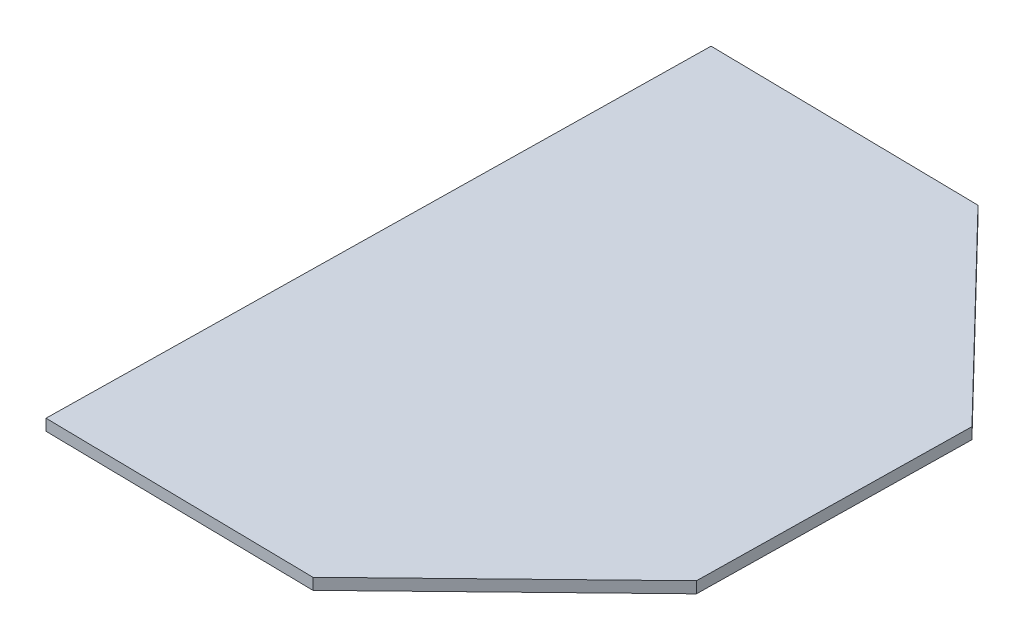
from build123d import *

# Parameters (mm, degrees)
BOSS_EXTRUDE1_DEPTH = 12


with BuildPart() as part:
    # Sketch1 → Boss-Extrude1 (new body)
    with BuildSketch(Plane(origin=(0, 0, 0), x_dir=(1, 0, 0), z_dir=(0, 1, 0))):
        Polygon((-138.018169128, 348.677479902), (-148.958627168, -344.145793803), (138.018169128, -348.677479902), (344.145793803, -148.958627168), (348.677479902, 138.018169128), (148.958627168, 344.145793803), align=None)
    extrude(amount=BOSS_EXTRUDE1_DEPTH)


solid = part.part
